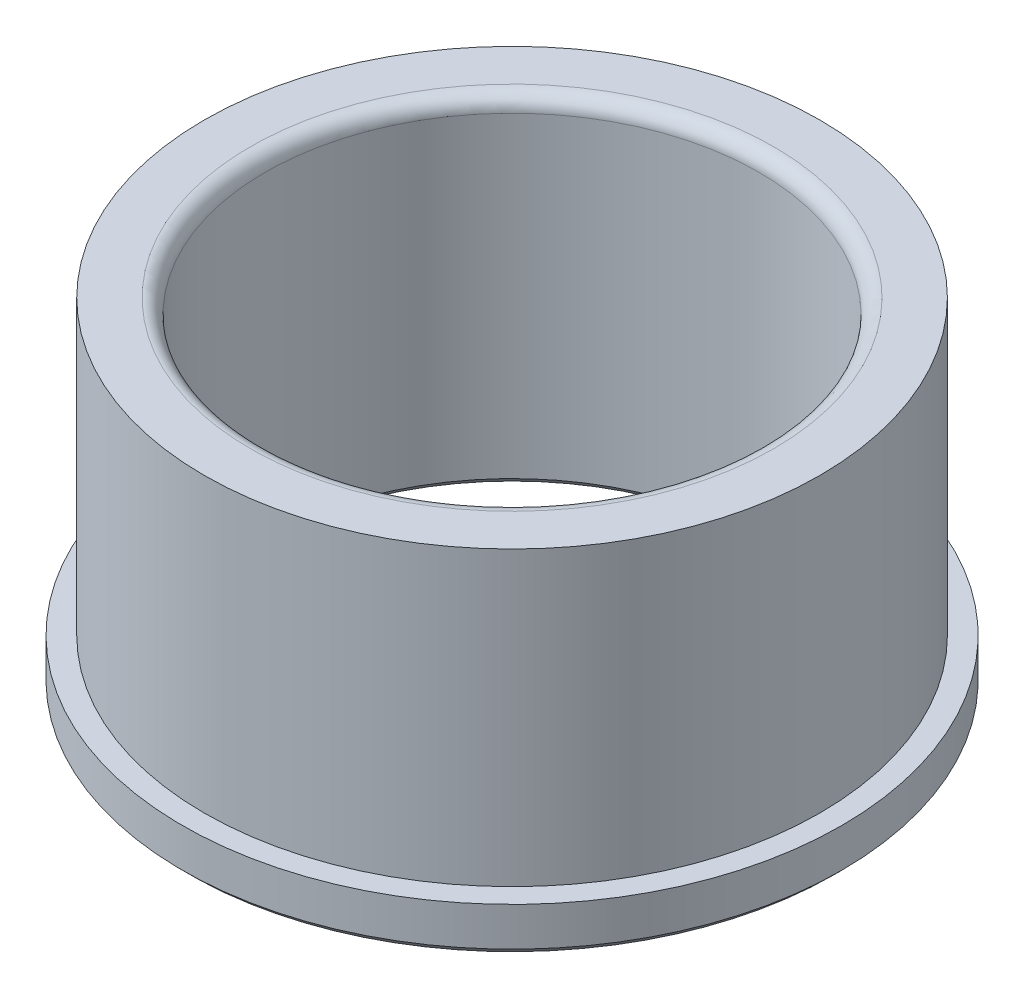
from build123d import *

# Parameters (mm, degrees)
FILLET1_R = 1.524


with BuildPart() as part:
    # Sketch1 → Revolve1 (revolve)
    with BuildSketch(Plane.XY, mode=Mode.PRIVATE) as revolve1_sk:
        Polygon((-33.2359, 0), (-33.9979, 0.762), (-33.9979, 4.7625), (-31.75635, 4.7625), (-31.75635, 34.925), (-25.4635, 34.925), (-25.4635, 0.762), (-26.2255, 0), align=None)
    revolve(revolve1_sk.sketch.rotate(Axis((0, -1000, 0), (0, 1, 0)), 180), axis=Axis((0, -1000, 0), (0, 1, 0)))

    # Fillet1
    fillet1_edges = [part.edges().sort_by_distance(p)[0] for p in [
        (-25.4635, 34.925, 0),
    ]]
    fillet(fillet1_edges, radius=FILLET1_R)


solid = part.part
